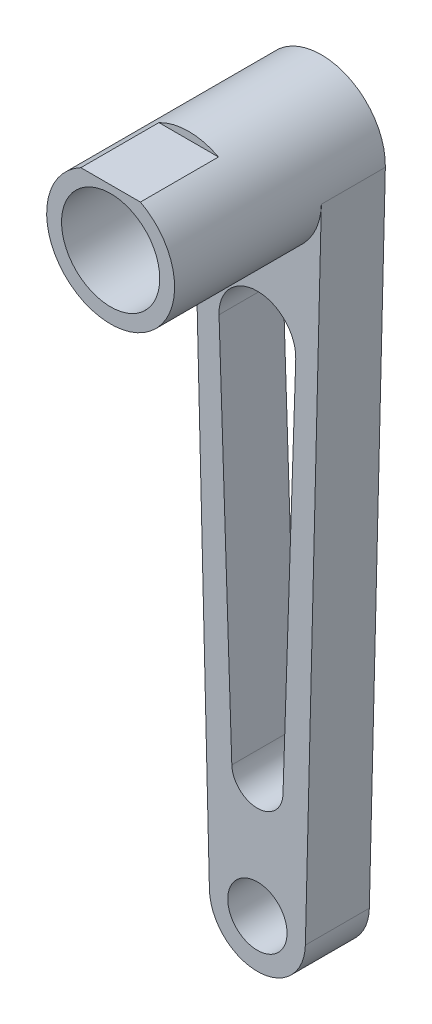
from build123d import *

# Parameters (mm, degrees)
SKETCH1_R           = 4.635
BOSS_EXTRUDE2_DEPTH = 10
SKETCH1_6_R         = 10
SKETCH1_6_R_2       = 7.675
BOSS_EXTRUDE3_DEPTH = 32.94
SKETCH2_W           = 20.025396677
SKETCH2_H           = 9.808205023
CUT_EXTRUDE1_DEPTH  = 12.2


with BuildPart() as part:
    # Sketch1 → Boss-Extrude2 (new body)
    with BuildSketch(Plane.XY):
        with BuildLine():
            Line((-9.996972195, -0.246062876), (-7.497729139, -101.784547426))
            ThreePointArc((-7.497729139, -101.784547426), (1.58e-07, -109.1), (7.497729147, -101.784547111))
            Line((7.497729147, -101.784547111), (9.996972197, -0.246062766))
            ThreePointArc((9.996972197, -0.246062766), (5.5e-08, -10), (-9.996972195, -0.246062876))
        make_face()
        with BuildLine():
            ThreePointArc((-5.996665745, -23.199999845), (2.1e-08, -17), (5.996665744, -23.199999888))
            Line((5.996665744, -23.199999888), (3.997777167, -83.133333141))
            ThreePointArc((3.997777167, -83.133333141), (1.93e-07, -87), (-3.997777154, -83.133333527))
            Line((-3.997777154, -83.133333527), (-5.996665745, -23.199999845))
        make_face(mode=Mode.SUBTRACT)
        with Locations((0, -101.6)):
            Circle(SKETCH1_R, mode=Mode.SUBTRACT)
    extrude(amount=BOSS_EXTRUDE2_DEPTH)

    # Sketch1_6 → Boss-Extrude3 (add)
    with BuildSketch(Plane.XY):
        with Locations(Location((0, 0, 0), (0, 0, 181.409979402))):
            Circle(SKETCH1_6_R)
        Circle(SKETCH1_6_R_2, mode=Mode.SUBTRACT)
    extrude(amount=BOSS_EXTRUDE3_DEPTH)

    # Sketch2 → Cut-Extrude1 (cut)
    with BuildSketch(Plane.XY.offset(32.94)):
        with Locations((-0.020605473, 13.754102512)):
            Rectangle(SKETCH2_W, SKETCH2_H)
    extrude(amount=-CUT_EXTRUDE1_DEPTH, mode=Mode.SUBTRACT)


solid = part.part
